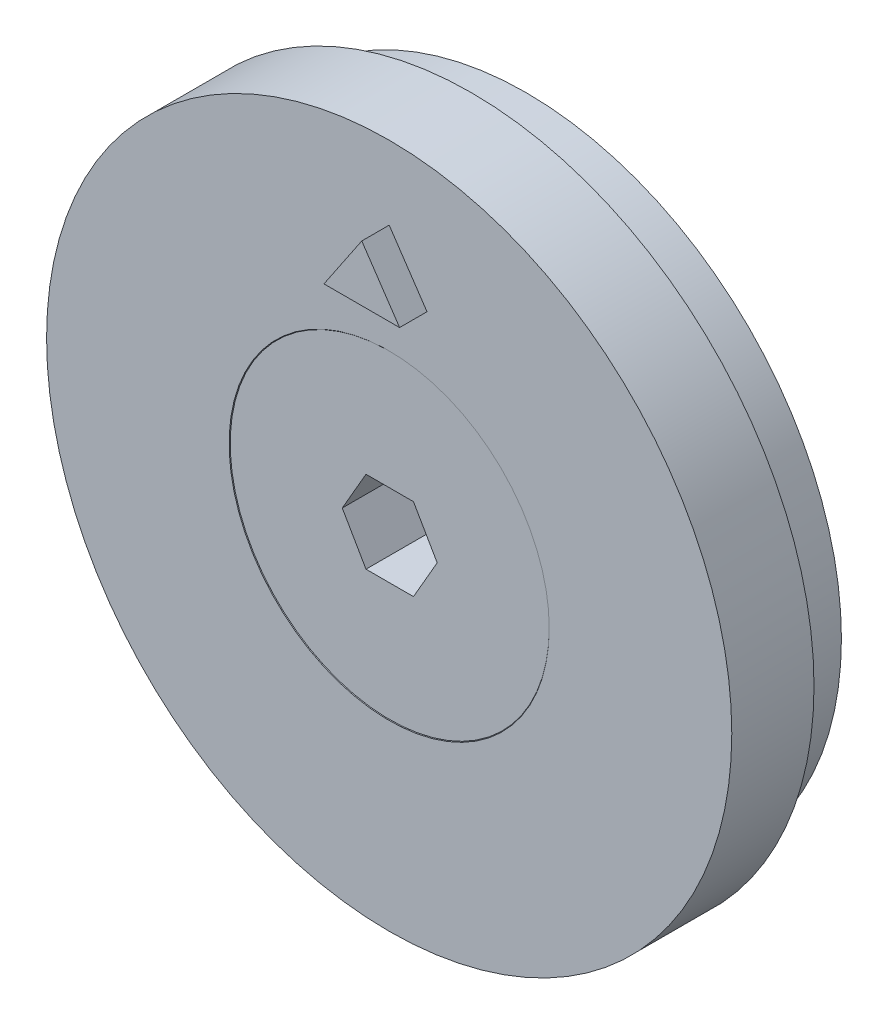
ISO-10303-21;
HEADER;
FILE_DESCRIPTION(('STEP AP214'),'2;1');
FILE_NAME('part.step','',(''),(''),'','','');
FILE_SCHEMA(('AUTOMOTIVE_DESIGN { 1 0 10303 214 1 1 1 1 }'));
ENDSEC;
DATA;
#1=APPLICATION_CONTEXT('core data for automotive mechanical design processes');
#2=APPLICATION_PROTOCOL_DEFINITION('international standard','automotive_design',2000,#1);
#3=PRODUCT_CONTEXT('',#1,'mechanical');
#4=PRODUCT('Part','Part','',(#3));
#5=PRODUCT_RELATED_PRODUCT_CATEGORY('part','',(#4));
#6=PRODUCT_DEFINITION_FORMATION('','',#4);
#7=PRODUCT_DEFINITION_CONTEXT('part definition',#1,'design');
#8=PRODUCT_DEFINITION('design','',#6,#7);
#9=PRODUCT_DEFINITION_SHAPE('','',#8);
#10=(LENGTH_UNIT() NAMED_UNIT(*) SI_UNIT(.MILLI.,.METRE.));
#11=(NAMED_UNIT(*) PLANE_ANGLE_UNIT() SI_UNIT($,.RADIAN.));
#12=(NAMED_UNIT(*) SI_UNIT($,.STERADIAN.) SOLID_ANGLE_UNIT());
#13=UNCERTAINTY_MEASURE_WITH_UNIT(LENGTH_MEASURE(1.E-05),#10,'distance_accuracy_value','');
#14=(GEOMETRIC_REPRESENTATION_CONTEXT(3) GLOBAL_UNCERTAINTY_ASSIGNED_CONTEXT((#13)) GLOBAL_UNIT_ASSIGNED_CONTEXT((#10,
#11,#12)) REPRESENTATION_CONTEXT('',''));
#15=CARTESIAN_POINT('',(0.,0.,0.));
#16=DIRECTION('',(0.,0.,1.));
#17=DIRECTION('',(1.,0.,0.));
#18=AXIS2_PLACEMENT_3D('',#15,#16,#17);
#19=CARTESIAN_POINT('',(0.,0.,-0.0199999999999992));
#20=DIRECTION('',(0.,0.,1.));
#21=DIRECTION('',(1.,0.,0.));
#22=AXIS2_PLACEMENT_3D('',#19,#20,#21);
#23=CYLINDRICAL_SURFACE('',#22,2.5);
#24=CARTESIAN_POINT('',(0.,0.,-3.34));
#25=DIRECTION('',(0.,0.,1.));
#26=DIRECTION('',(1.,0.,0.));
#27=AXIS2_PLACEMENT_3D('',#24,#25,#26);
#28=CIRCLE('',#27,2.5);
#29=CARTESIAN_POINT('',(2.5,0.,-3.34));
#30=VERTEX_POINT('',#29);
#31=EDGE_CURVE('P0_E11',#30,#30,#28,.T.);
#32=ORIENTED_EDGE('',*,*,#31,.F.);
#33=EDGE_LOOP('',(#32));
#34=FACE_BOUND('',#33,.T.);
#35=CARTESIAN_POINT('',(0.,0.,-9.77));
#36=DIRECTION('',(0.,0.,1.));
#37=DIRECTION('',(1.,0.,0.));
#38=AXIS2_PLACEMENT_3D('',#35,#36,#37);
#39=CIRCLE('',#38,2.5);
#40=CARTESIAN_POINT('',(2.5,0.,-9.77));
#41=VERTEX_POINT('',#40);
#42=EDGE_CURVE('P0_E136',#41,#41,#39,.T.);
#43=ORIENTED_EDGE('',*,*,#42,.T.);
#44=EDGE_LOOP('',(#43));
#45=FACE_BOUND('',#44,.T.);
#46=ADVANCED_FACE('P0_F35',(#34,#45),#23,.T.);
#47=CARTESIAN_POINT('',(0.,0.,-3.34));
#48=DIRECTION('',(0.,0.,1.));
#49=DIRECTION('',(1.,0.,0.));
#50=AXIS2_PLACEMENT_3D('',#47,#48,#49);
#51=CONICAL_SURFACE('',#50,2.5,0.785398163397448);
#52=CARTESIAN_POINT('',(0.,0.,-0.0199999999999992));
#53=DIRECTION('',(0.,0.,1.));
#54=DIRECTION('',(1.,0.,0.));
#55=AXIS2_PLACEMENT_3D('',#52,#53,#54);
#56=CIRCLE('',#55,5.82);
#57=CARTESIAN_POINT('',(5.82,0.,-0.0199999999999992));
#58=VERTEX_POINT('',#57);
#59=EDGE_CURVE('P0_E42',#58,#58,#56,.T.);
#60=ORIENTED_EDGE('',*,*,#59,.F.);
#61=EDGE_LOOP('',(#60));
#62=FACE_BOUND('',#61,.T.);
#63=ORIENTED_EDGE('',*,*,#31,.T.);
#64=EDGE_LOOP('',(#63));
#65=FACE_BOUND('',#64,.T.);
#66=ADVANCED_FACE('P0_F151',(#62,#65),#51,.T.);
#67=CARTESIAN_POINT('',(0.,5.82,-0.0199999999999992));
#68=DIRECTION('',(0.,0.,-1.));
#69=DIRECTION('',(-1.,0.,0.));
#70=AXIS2_PLACEMENT_3D('',#67,#68,#69);
#71=PLANE('',#70);
#72=DIRECTION('',(1.,0.,0.));
#73=VECTOR('',#72,1.);
#74=CARTESIAN_POINT('',(-0.866025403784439,-1.5,-0.0199999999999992));
#75=LINE('',#74,#73);
#76=CARTESIAN_POINT('',(-0.866025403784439,-1.5,-0.0199999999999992));
#77=VERTEX_POINT('',#76);
#78=CARTESIAN_POINT('',(0.866025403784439,-1.5,-0.0199999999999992));
#79=VERTEX_POINT('',#78);
#80=EDGE_CURVE('P0_E123',#77,#79,#75,.T.);
#81=ORIENTED_EDGE('',*,*,#80,.F.);
#82=DIRECTION('',(0.5,-0.866025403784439,0.));
#83=VECTOR('',#82,1.);
#84=CARTESIAN_POINT('',(-1.73205080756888,0.,-0.0199999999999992));
#85=LINE('',#84,#83);
#86=CARTESIAN_POINT('',(-1.73205080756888,0.,-0.0199999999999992));
#87=VERTEX_POINT('',#86);
#88=EDGE_CURVE('P0_E49',#87,#77,#85,.T.);
#89=ORIENTED_EDGE('',*,*,#88,.F.);
#90=DIRECTION('',(-0.5,-0.866025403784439,0.));
#91=VECTOR('',#90,1.);
#92=CARTESIAN_POINT('',(-0.866025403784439,1.5,-0.0199999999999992));
#93=LINE('',#92,#91);
#94=CARTESIAN_POINT('',(-0.866025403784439,1.5,-0.0199999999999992));
#95=VERTEX_POINT('',#94);
#96=EDGE_CURVE('P0_E132',#95,#87,#93,.T.);
#97=ORIENTED_EDGE('',*,*,#96,.F.);
#98=DIRECTION('',(-1.,0.,0.));
#99=VECTOR('',#98,1.);
#100=CARTESIAN_POINT('',(0.866025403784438,1.5,-0.0199999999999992));
#101=LINE('',#100,#99);
#102=CARTESIAN_POINT('',(0.866025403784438,1.5,-0.0199999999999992));
#103=VERTEX_POINT('',#102);
#104=EDGE_CURVE('P0_E130',#103,#95,#101,.T.);
#105=ORIENTED_EDGE('',*,*,#104,.F.);
#106=DIRECTION('',(-0.5,0.866025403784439,0.));
#107=VECTOR('',#106,1.);
#108=CARTESIAN_POINT('',(1.73205080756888,0.,-0.0199999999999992));
#109=LINE('',#108,#107);
#110=CARTESIAN_POINT('',(1.73205080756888,0.,-0.0199999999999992));
#111=VERTEX_POINT('',#110);
#112=EDGE_CURVE('P0_E97',#111,#103,#109,.T.);
#113=ORIENTED_EDGE('',*,*,#112,.F.);
#114=DIRECTION('',(0.5,0.866025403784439,0.));
#115=VECTOR('',#114,1.);
#116=CARTESIAN_POINT('',(0.866025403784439,-1.5,-0.0199999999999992));
#117=LINE('',#116,#115);
#118=EDGE_CURVE('P0_E126',#79,#111,#117,.T.);
#119=ORIENTED_EDGE('',*,*,#118,.F.);
#120=EDGE_LOOP('',(#81,#89,#97,#105,#113,#119));
#121=FACE_BOUND('',#120,.T.);
#122=ORIENTED_EDGE('',*,*,#59,.T.);
#123=EDGE_LOOP('',(#122));
#124=FACE_BOUND('',#123,.T.);
#125=ADVANCED_FACE('P0_F149',(#121,#124),#71,.F.);
#126=CARTESIAN_POINT('',(0.,0.,-10.02));
#127=DIRECTION('',(0.,0.,1.));
#128=DIRECTION('',(1.,0.,0.));
#129=AXIS2_PLACEMENT_3D('',#126,#127,#128);
#130=PLANE('',#129);
#131=CARTESIAN_POINT('',(0.,0.,-10.02));
#132=DIRECTION('',(0.,0.,1.));
#133=DIRECTION('',(1.,0.,0.));
#134=AXIS2_PLACEMENT_3D('',#131,#132,#133);
#135=CIRCLE('',#134,2.25);
#136=CARTESIAN_POINT('',(2.25,0.,-10.02));
#137=VERTEX_POINT('',#136);
#138=EDGE_CURVE('P0_E144',#137,#137,#135,.T.);
#139=ORIENTED_EDGE('',*,*,#138,.F.);
#140=EDGE_LOOP('',(#139));
#141=FACE_BOUND('',#140,.T.);
#142=ADVANCED_FACE('P0_F164',(#141),#130,.F.);
#143=CARTESIAN_POINT('',(0.,0.,-10.02));
#144=DIRECTION('',(0.,0.,1.));
#145=DIRECTION('',(1.,0.,0.));
#146=AXIS2_PLACEMENT_3D('',#143,#144,#145);
#147=CONICAL_SURFACE('',#146,2.25,0.78539816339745);
#148=ORIENTED_EDGE('',*,*,#42,.F.);
#149=EDGE_LOOP('',(#148));
#150=FACE_BOUND('',#149,.T.);
#151=ORIENTED_EDGE('',*,*,#138,.T.);
#152=EDGE_LOOP('',(#151));
#153=FACE_BOUND('',#152,.T.);
#154=ADVANCED_FACE('P0_F160',(#150,#153),#147,.T.);
#155=CARTESIAN_POINT('',(-1.73205080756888,0.,-2.52));
#156=DIRECTION('',(-0.866025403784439,-0.5,0.));
#157=DIRECTION('',(0.5,-0.866025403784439,0.));
#158=AXIS2_PLACEMENT_3D('',#155,#156,#157);
#159=PLANE('',#158);
#160=ORIENTED_EDGE('',*,*,#88,.T.);
#161=DIRECTION('',(0.,0.,1.));
#162=VECTOR('',#161,1.);
#163=CARTESIAN_POINT('',(-0.866025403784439,-1.5,-2.52));
#164=LINE('',#163,#162);
#165=CARTESIAN_POINT('',(-0.866025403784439,-1.5,-2.52));
#166=VERTEX_POINT('',#165);
#167=EDGE_CURVE('P0_E79',#166,#77,#164,.T.);
#168=ORIENTED_EDGE('',*,*,#167,.F.);
#169=DIRECTION('',(0.5,-0.866025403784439,0.));
#170=VECTOR('',#169,1.);
#171=CARTESIAN_POINT('',(-1.73205080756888,0.,-2.52));
#172=LINE('',#171,#170);
#173=CARTESIAN_POINT('',(-1.73205080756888,0.,-2.52));
#174=VERTEX_POINT('',#173);
#175=EDGE_CURVE('P0_E134',#174,#166,#172,.T.);
#176=ORIENTED_EDGE('',*,*,#175,.F.);
#177=DIRECTION('',(0.,0.,1.));
#178=VECTOR('',#177,1.);
#179=CARTESIAN_POINT('',(-1.73205080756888,0.,-2.52));
#180=LINE('',#179,#178);
#181=EDGE_CURVE('P0_E57',#174,#87,#180,.T.);
#182=ORIENTED_EDGE('',*,*,#181,.T.);
#183=EDGE_LOOP('',(#160,#168,#176,#182));
#184=FACE_BOUND('',#183,.T.);
#185=ADVANCED_FACE('P0_F163',(#184),#159,.F.);
#186=CARTESIAN_POINT('',(-0.866025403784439,1.5,-2.52));
#187=DIRECTION('',(-0.866025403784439,0.5,0.));
#188=DIRECTION('',(-0.5,-0.866025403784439,0.));
#189=AXIS2_PLACEMENT_3D('',#186,#187,#188);
#190=PLANE('',#189);
#191=ORIENTED_EDGE('',*,*,#96,.T.);
#192=ORIENTED_EDGE('',*,*,#181,.F.);
#193=DIRECTION('',(-0.5,-0.866025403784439,0.));
#194=VECTOR('',#193,1.);
#195=CARTESIAN_POINT('',(-0.866025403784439,1.5,-2.52));
#196=LINE('',#195,#194);
#197=CARTESIAN_POINT('',(-0.866025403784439,1.5,-2.52));
#198=VERTEX_POINT('',#197);
#199=EDGE_CURVE('P0_E109',#198,#174,#196,.T.);
#200=ORIENTED_EDGE('',*,*,#199,.F.);
#201=DIRECTION('',(0.,0.,1.));
#202=VECTOR('',#201,1.);
#203=CARTESIAN_POINT('',(-0.866025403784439,1.5,-2.52));
#204=LINE('',#203,#202);
#205=EDGE_CURVE('P0_E101',#198,#95,#204,.T.);
#206=ORIENTED_EDGE('',*,*,#205,.T.);
#207=EDGE_LOOP('',(#191,#192,#200,#206));
#208=FACE_BOUND('',#207,.T.);
#209=ADVANCED_FACE('P0_F178',(#208),#190,.F.);
#210=CARTESIAN_POINT('',(0.866025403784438,1.5,-2.52));
#211=DIRECTION('',(0.,1.,0.));
#212=DIRECTION('',(-1.,0.,0.));
#213=AXIS2_PLACEMENT_3D('',#210,#211,#212);
#214=PLANE('',#213);
#215=ORIENTED_EDGE('',*,*,#104,.T.);
#216=ORIENTED_EDGE('',*,*,#205,.F.);
#217=DIRECTION('',(-1.,0.,0.));
#218=VECTOR('',#217,1.);
#219=CARTESIAN_POINT('',(0.866025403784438,1.5,-2.52));
#220=LINE('',#219,#218);
#221=CARTESIAN_POINT('',(0.866025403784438,1.5,-2.52));
#222=VERTEX_POINT('',#221);
#223=EDGE_CURVE('P0_E105',#222,#198,#220,.T.);
#224=ORIENTED_EDGE('',*,*,#223,.F.);
#225=DIRECTION('',(0.,0.,1.));
#226=VECTOR('',#225,1.);
#227=CARTESIAN_POINT('',(0.866025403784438,1.5,-2.52));
#228=LINE('',#227,#226);
#229=EDGE_CURVE('P0_E90',#222,#103,#228,.T.);
#230=ORIENTED_EDGE('',*,*,#229,.T.);
#231=EDGE_LOOP('',(#215,#216,#224,#230));
#232=FACE_BOUND('',#231,.T.);
#233=ADVANCED_FACE('P0_F106',(#232),#214,.F.);
#234=CARTESIAN_POINT('',(1.73205080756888,0.,-2.52));
#235=DIRECTION('',(0.866025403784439,0.5,0.));
#236=DIRECTION('',(-0.5,0.866025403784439,0.));
#237=AXIS2_PLACEMENT_3D('',#234,#235,#236);
#238=PLANE('',#237);
#239=ORIENTED_EDGE('',*,*,#112,.T.);
#240=ORIENTED_EDGE('',*,*,#229,.F.);
#241=DIRECTION('',(-0.5,0.866025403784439,0.));
#242=VECTOR('',#241,1.);
#243=CARTESIAN_POINT('',(1.73205080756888,0.,-2.52));
#244=LINE('',#243,#242);
#245=CARTESIAN_POINT('',(1.73205080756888,0.,-2.52));
#246=VERTEX_POINT('',#245);
#247=EDGE_CURVE('P0_E94',#246,#222,#244,.T.);
#248=ORIENTED_EDGE('',*,*,#247,.F.);
#249=DIRECTION('',(0.,0.,1.));
#250=VECTOR('',#249,1.);
#251=CARTESIAN_POINT('',(1.73205080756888,0.,-2.52));
#252=LINE('',#251,#250);
#253=EDGE_CURVE('P0_E102',#246,#111,#252,.T.);
#254=ORIENTED_EDGE('',*,*,#253,.T.);
#255=EDGE_LOOP('',(#239,#240,#248,#254));
#256=FACE_BOUND('',#255,.T.);
#257=ADVANCED_FACE('P0_F92',(#256),#238,.F.);
#258=CARTESIAN_POINT('',(0.866025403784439,-1.5,-2.52));
#259=DIRECTION('',(0.866025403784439,-0.5,0.));
#260=DIRECTION('',(0.5,0.866025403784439,0.));
#261=AXIS2_PLACEMENT_3D('',#258,#259,#260);
#262=PLANE('',#261);
#263=ORIENTED_EDGE('',*,*,#118,.T.);
#264=ORIENTED_EDGE('',*,*,#253,.F.);
#265=DIRECTION('',(0.5,0.866025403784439,0.));
#266=VECTOR('',#265,1.);
#267=CARTESIAN_POINT('',(0.866025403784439,-1.5,-2.52));
#268=LINE('',#267,#266);
#269=CARTESIAN_POINT('',(0.866025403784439,-1.5,-2.52));
#270=VERTEX_POINT('',#269);
#271=EDGE_CURVE('P0_E115',#270,#246,#268,.T.);
#272=ORIENTED_EDGE('',*,*,#271,.F.);
#273=DIRECTION('',(0.,0.,1.));
#274=VECTOR('',#273,1.);
#275=CARTESIAN_POINT('',(0.866025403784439,-1.5,-2.52));
#276=LINE('',#275,#274);
#277=EDGE_CURVE('P0_E139',#270,#79,#276,.T.);
#278=ORIENTED_EDGE('',*,*,#277,.T.);
#279=EDGE_LOOP('',(#263,#264,#272,#278));
#280=FACE_BOUND('',#279,.T.);
#281=ADVANCED_FACE('P0_F182',(#280),#262,.F.);
#282=CARTESIAN_POINT('',(-0.866025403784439,-1.5,-2.52));
#283=DIRECTION('',(0.,-1.,0.));
#284=DIRECTION('',(0.,0.,-1.));
#285=AXIS2_PLACEMENT_3D('',#282,#283,#284);
#286=PLANE('',#285);
#287=ORIENTED_EDGE('',*,*,#80,.T.);
#288=ORIENTED_EDGE('',*,*,#277,.F.);
#289=DIRECTION('',(1.,0.,0.));
#290=VECTOR('',#289,1.);
#291=CARTESIAN_POINT('',(-0.866025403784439,-1.5,-2.52));
#292=LINE('',#291,#290);
#293=EDGE_CURVE('P0_E117',#166,#270,#292,.T.);
#294=ORIENTED_EDGE('',*,*,#293,.F.);
#295=ORIENTED_EDGE('',*,*,#167,.T.);
#296=EDGE_LOOP('',(#287,#288,#294,#295));
#297=FACE_BOUND('',#296,.T.);
#298=ADVANCED_FACE('P0_F179',(#297),#286,.F.);
#299=CARTESIAN_POINT('',(0.,0.,-2.52));
#300=DIRECTION('',(0.,0.,1.));
#301=DIRECTION('',(1.,0.,0.));
#302=AXIS2_PLACEMENT_3D('',#299,#300,#301);
#303=PLANE('',#302);
#304=ORIENTED_EDGE('',*,*,#175,.T.);
#305=ORIENTED_EDGE('',*,*,#293,.T.);
#306=ORIENTED_EDGE('',*,*,#271,.T.);
#307=ORIENTED_EDGE('',*,*,#247,.T.);
#308=ORIENTED_EDGE('',*,*,#223,.T.);
#309=ORIENTED_EDGE('',*,*,#199,.T.);
#310=EDGE_LOOP('',(#304,#305,#306,#307,#308,#309));
#311=FACE_BOUND('',#310,.T.);
#312=ADVANCED_FACE('P0_F112',(#311),#303,.T.);
#313=CLOSED_SHELL('',(#46,#66,#125,#142,#154,#185,#209,#233,#257,#281,#298,#312));
#314=MANIFOLD_SOLID_BREP('P0_B2',#313);
#315=CARTESIAN_POINT('',(0.,12.5,0.));
#316=DIRECTION('',(0.,0.,-1.));
#317=DIRECTION('',(-1.,0.,0.));
#318=AXIS2_PLACEMENT_3D('',#315,#316,#317);
#319=PLANE('',#318);
#320=CARTESIAN_POINT('',(0.,0.,0.));
#321=DIRECTION('',(0.,0.,1.));
#322=DIRECTION('',(1.,0.,0.));
#323=AXIS2_PLACEMENT_3D('',#320,#321,#322);
#324=CIRCLE('',#323,12.5);
#325=CARTESIAN_POINT('',(12.5,0.,0.));
#326=VERTEX_POINT('',#325);
#327=EDGE_CURVE('P1_E11',#326,#326,#324,.T.);
#328=ORIENTED_EDGE('',*,*,#327,.T.);
#329=EDGE_LOOP('',(#328));
#330=FACE_BOUND('',#329,.T.);
#331=CARTESIAN_POINT('',(0.,0.,0.));
#332=DIRECTION('',(0.,0.,1.));
#333=DIRECTION('',(1.,0.,0.));
#334=AXIS2_PLACEMENT_3D('',#331,#332,#333);
#335=CIRCLE('',#334,5.84);
#336=CARTESIAN_POINT('',(5.84,0.,0.));
#337=VERTEX_POINT('',#336);
#338=EDGE_CURVE('P1_E25',#337,#337,#335,.T.);
#339=ORIENTED_EDGE('',*,*,#338,.F.);
#340=EDGE_LOOP('',(#339));
#341=FACE_BOUND('',#340,.T.);
#342=DIRECTION('',(1.,0.,0.));
#343=VECTOR('',#342,1.);
#344=CARTESIAN_POINT('',(-1.3800444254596,7.76799984,0.));
#345=LINE('',#344,#343);
#346=CARTESIAN_POINT('',(-1.3800444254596,7.76799984,0.));
#347=VERTEX_POINT('',#346);
#348=CARTESIAN_POINT('',(1.3800444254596,7.76799984,0.));
#349=VERTEX_POINT('',#348);
#350=EDGE_CURVE('P1_E69',#347,#349,#345,.T.);
#351=ORIENTED_EDGE('',*,*,#350,.F.);
#352=DIRECTION('',(-0.559192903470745,-0.829037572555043,0.));
#353=VECTOR('',#352,1.);
#354=CARTESIAN_POINT('',(0.,9.81399984,0.));
#355=LINE('',#354,#353);
#356=CARTESIAN_POINT('',(0.,9.81399984,0.));
#357=VERTEX_POINT('',#356);
#358=EDGE_CURVE('P1_E36',#357,#347,#355,.T.);
#359=ORIENTED_EDGE('',*,*,#358,.F.);
#360=DIRECTION('',(-0.559192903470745,0.829037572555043,0.));
#361=VECTOR('',#360,1.);
#362=CARTESIAN_POINT('',(1.3800444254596,7.76799984,0.));
#363=LINE('',#362,#361);
#364=EDGE_CURVE('P1_E32',#349,#357,#363,.T.);
#365=ORIENTED_EDGE('',*,*,#364,.F.);
#366=EDGE_LOOP('',(#351,#359,#365));
#367=FACE_BOUND('',#366,.T.);
#368=ADVANCED_FACE('P1_F17',(#330,#341,#367),#319,.F.);
#369=CARTESIAN_POINT('',(0.,0.,3.12219627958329));
#370=DIRECTION('',(0.,0.,1.));
#371=DIRECTION('',(1.,0.,0.));
#372=AXIS2_PLACEMENT_3D('',#369,#370,#371);
#373=CYLINDRICAL_SURFACE('',#372,12.5);
#374=ORIENTED_EDGE('',*,*,#327,.F.);
#375=EDGE_LOOP('',(#374));
#376=FACE_BOUND('',#375,.T.);
#377=CARTESIAN_POINT('',(0.,0.,-3.));
#378=DIRECTION('',(0.,0.,1.));
#379=DIRECTION('',(1.,0.,0.));
#380=AXIS2_PLACEMENT_3D('',#377,#378,#379);
#381=CIRCLE('',#380,12.5);
#382=CARTESIAN_POINT('',(12.5,0.,-3.));
#383=VERTEX_POINT('',#382);
#384=EDGE_CURVE('P1_E70',#383,#383,#381,.T.);
#385=ORIENTED_EDGE('',*,*,#384,.T.);
#386=EDGE_LOOP('',(#385));
#387=FACE_BOUND('',#386,.T.);
#388=ADVANCED_FACE('P1_F19',(#376,#387),#373,.T.);
#389=CARTESIAN_POINT('',(0.,0.,0.));
#390=DIRECTION('',(0.,0.,1.));
#391=DIRECTION('',(1.,0.,0.));
#392=AXIS2_PLACEMENT_3D('',#389,#390,#391);
#393=CONICAL_SURFACE('',#392,5.84,0.785398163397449);
#394=CARTESIAN_POINT('',(0.,0.,-3.34));
#395=DIRECTION('',(0.,0.,1.));
#396=DIRECTION('',(1.,0.,0.));
#397=AXIS2_PLACEMENT_3D('',#394,#395,#396);
#398=CIRCLE('',#397,2.5);
#399=CARTESIAN_POINT('',(2.5,0.,-3.34));
#400=VERTEX_POINT('',#399);
#401=EDGE_CURVE('P1_E87',#400,#400,#398,.T.);
#402=ORIENTED_EDGE('',*,*,#401,.F.);
#403=EDGE_LOOP('',(#402));
#404=FACE_BOUND('',#403,.T.);
#405=ORIENTED_EDGE('',*,*,#338,.T.);
#406=EDGE_LOOP('',(#405));
#407=FACE_BOUND('',#406,.T.);
#408=ADVANCED_FACE('P1_F92',(#404,#407),#393,.F.);
#409=CARTESIAN_POINT('',(0.,0.,3.12219627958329));
#410=DIRECTION('',(0.,0.,1.));
#411=DIRECTION('',(1.,0.,0.));
#412=AXIS2_PLACEMENT_3D('',#409,#410,#411);
#413=CYLINDRICAL_SURFACE('',#412,2.5);
#414=CARTESIAN_POINT('',(0.,0.,-5.));
#415=DIRECTION('',(0.,0.,1.));
#416=DIRECTION('',(1.,0.,0.));
#417=AXIS2_PLACEMENT_3D('',#414,#415,#416);
#418=CIRCLE('',#417,2.5);
#419=CARTESIAN_POINT('',(2.5,0.,-5.));
#420=VERTEX_POINT('',#419);
#421=EDGE_CURVE('P1_E84',#420,#420,#418,.T.);
#422=ORIENTED_EDGE('',*,*,#421,.F.);
#423=EDGE_LOOP('',(#422));
#424=FACE_BOUND('',#423,.T.);
#425=ORIENTED_EDGE('',*,*,#401,.T.);
#426=EDGE_LOOP('',(#425));
#427=FACE_BOUND('',#426,.T.);
#428=ADVANCED_FACE('P1_F126',(#424,#427),#413,.F.);
#429=CARTESIAN_POINT('',(0.,2.5,-5.));
#430=DIRECTION('',(0.,0.,1.));
#431=DIRECTION('',(1.,0.,0.));
#432=AXIS2_PLACEMENT_3D('',#429,#430,#431);
#433=PLANE('',#432);
#434=CARTESIAN_POINT('',(0.,0.,-5.));
#435=DIRECTION('',(0.,0.,1.));
#436=DIRECTION('',(1.,0.,0.));
#437=AXIS2_PLACEMENT_3D('',#434,#435,#436);
#438=CIRCLE('',#437,11.5);
#439=CARTESIAN_POINT('',(11.5,0.,-5.));
#440=VERTEX_POINT('',#439);
#441=EDGE_CURVE('P1_E81',#440,#440,#438,.T.);
#442=ORIENTED_EDGE('',*,*,#441,.F.);
#443=EDGE_LOOP('',(#442));
#444=FACE_BOUND('',#443,.T.);
#445=ORIENTED_EDGE('',*,*,#421,.T.);
#446=EDGE_LOOP('',(#445));
#447=FACE_BOUND('',#446,.T.);
#448=ADVANCED_FACE('P1_F122',(#444,#447),#433,.F.);
#449=CARTESIAN_POINT('',(0.,0.,3.12219627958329));
#450=DIRECTION('',(0.,0.,1.));
#451=DIRECTION('',(1.,0.,0.));
#452=AXIS2_PLACEMENT_3D('',#449,#450,#451);
#453=CYLINDRICAL_SURFACE('',#452,11.5);
#454=CARTESIAN_POINT('',(0.,0.,-3.));
#455=DIRECTION('',(0.,0.,1.));
#456=DIRECTION('',(1.,0.,0.));
#457=AXIS2_PLACEMENT_3D('',#454,#455,#456);
#458=CIRCLE('',#457,11.5);
#459=CARTESIAN_POINT('',(11.5,0.,-3.));
#460=VERTEX_POINT('',#459);
#461=EDGE_CURVE('P1_E73',#460,#460,#458,.T.);
#462=ORIENTED_EDGE('',*,*,#461,.F.);
#463=EDGE_LOOP('',(#462));
#464=FACE_BOUND('',#463,.T.);
#465=ORIENTED_EDGE('',*,*,#441,.T.);
#466=EDGE_LOOP('',(#465));
#467=FACE_BOUND('',#466,.T.);
#468=ADVANCED_FACE('P1_F118',(#464,#467),#453,.T.);
#469=CARTESIAN_POINT('',(0.,11.5,-3.));
#470=DIRECTION('',(0.,0.,1.));
#471=DIRECTION('',(1.,0.,0.));
#472=AXIS2_PLACEMENT_3D('',#469,#470,#471);
#473=PLANE('',#472);
#474=ORIENTED_EDGE('',*,*,#384,.F.);
#475=EDGE_LOOP('',(#474));
#476=FACE_BOUND('',#475,.T.);
#477=ORIENTED_EDGE('',*,*,#461,.T.);
#478=EDGE_LOOP('',(#477));
#479=FACE_BOUND('',#478,.T.);
#480=ADVANCED_FACE('P1_F115',(#476,#479),#473,.F.);
#481=CARTESIAN_POINT('',(-1.3800444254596,7.76799984,1.));
#482=DIRECTION('',(0.,1.,0.));
#483=DIRECTION('',(0.,0.,1.));
#484=AXIS2_PLACEMENT_3D('',#481,#482,#483);
#485=PLANE('',#484);
#486=ORIENTED_EDGE('',*,*,#350,.T.);
#487=DIRECTION('',(0.,0.,-1.));
#488=VECTOR('',#487,1.);
#489=CARTESIAN_POINT('',(1.3800444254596,7.76799984,1.));
#490=LINE('',#489,#488);
#491=CARTESIAN_POINT('',(1.3800444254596,7.76799984,1.));
#492=VERTEX_POINT('',#491);
#493=EDGE_CURVE('P1_E53',#492,#349,#490,.T.);
#494=ORIENTED_EDGE('',*,*,#493,.F.);
#495=DIRECTION('',(1.,0.,0.));
#496=VECTOR('',#495,1.);
#497=CARTESIAN_POINT('',(-1.3800444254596,7.76799984,1.));
#498=LINE('',#497,#496);
#499=CARTESIAN_POINT('',(-1.3800444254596,7.76799984,1.));
#500=VERTEX_POINT('',#499);
#501=EDGE_CURVE('P1_E60',#500,#492,#498,.T.);
#502=ORIENTED_EDGE('',*,*,#501,.F.);
#503=DIRECTION('',(0.,0.,-1.));
#504=VECTOR('',#503,1.);
#505=CARTESIAN_POINT('',(-1.3800444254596,7.76799984,1.));
#506=LINE('',#505,#504);
#507=EDGE_CURVE('P1_E75',#500,#347,#506,.T.);
#508=ORIENTED_EDGE('',*,*,#507,.T.);
#509=EDGE_LOOP('',(#486,#494,#502,#508));
#510=FACE_BOUND('',#509,.T.);
#511=ADVANCED_FACE('P1_F68',(#510),#485,.F.);
#512=CARTESIAN_POINT('',(1.3800444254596,7.76799984,1.));
#513=DIRECTION('',(-0.829037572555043,-0.559192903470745,0.));
#514=DIRECTION('',(0.559192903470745,-0.829037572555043,0.));
#515=AXIS2_PLACEMENT_3D('',#512,#513,#514);
#516=PLANE('',#515);
#517=ORIENTED_EDGE('',*,*,#364,.T.);
#518=DIRECTION('',(0.,0.,-1.));
#519=VECTOR('',#518,1.);
#520=CARTESIAN_POINT('',(0.,9.81399984,1.));
#521=LINE('',#520,#519);
#522=CARTESIAN_POINT('',(0.,9.81399984,1.));
#523=VERTEX_POINT('',#522);
#524=EDGE_CURVE('P1_E56',#523,#357,#521,.T.);
#525=ORIENTED_EDGE('',*,*,#524,.F.);
#526=DIRECTION('',(-0.559192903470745,0.829037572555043,0.));
#527=VECTOR('',#526,1.);
#528=CARTESIAN_POINT('',(1.3800444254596,7.76799984,1.));
#529=LINE('',#528,#527);
#530=EDGE_CURVE('P1_E49',#492,#523,#529,.T.);
#531=ORIENTED_EDGE('',*,*,#530,.F.);
#532=ORIENTED_EDGE('',*,*,#493,.T.);
#533=EDGE_LOOP('',(#517,#525,#531,#532));
#534=FACE_BOUND('',#533,.T.);
#535=ADVANCED_FACE('P1_F51',(#534),#516,.F.);
#536=CARTESIAN_POINT('',(0.,9.81399984,1.));
#537=DIRECTION('',(0.829037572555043,-0.559192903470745,0.));
#538=DIRECTION('',(0.559192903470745,0.829037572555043,0.));
#539=AXIS2_PLACEMENT_3D('',#536,#537,#538);
#540=PLANE('',#539);
#541=ORIENTED_EDGE('',*,*,#358,.T.);
#542=ORIENTED_EDGE('',*,*,#507,.F.);
#543=DIRECTION('',(-0.559192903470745,-0.829037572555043,0.));
#544=VECTOR('',#543,1.);
#545=CARTESIAN_POINT('',(0.,9.81399984,1.));
#546=LINE('',#545,#544);
#547=EDGE_CURVE('P1_E59',#523,#500,#546,.T.);
#548=ORIENTED_EDGE('',*,*,#547,.F.);
#549=ORIENTED_EDGE('',*,*,#524,.T.);
#550=EDGE_LOOP('',(#541,#542,#548,#549));
#551=FACE_BOUND('',#550,.T.);
#552=ADVANCED_FACE('P1_F98',(#551),#540,.F.);
#553=CARTESIAN_POINT('',(1.3800444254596,7.76799984,1.));
#554=DIRECTION('',(0.,0.,1.));
#555=DIRECTION('',(1.,0.,0.));
#556=AXIS2_PLACEMENT_3D('',#553,#554,#555);
#557=PLANE('',#556);
#558=ORIENTED_EDGE('',*,*,#501,.T.);
#559=ORIENTED_EDGE('',*,*,#530,.T.);
#560=ORIENTED_EDGE('',*,*,#547,.T.);
#561=EDGE_LOOP('',(#558,#559,#560));
#562=FACE_BOUND('',#561,.T.);
#563=ADVANCED_FACE('P1_F63',(#562),#557,.T.);
#564=CLOSED_SHELL('',(#368,#388,#408,#428,#448,#468,#480,#511,#535,#552,#563));
#565=MANIFOLD_SOLID_BREP('P1_B1',#564);
#566=ADVANCED_BREP_SHAPE_REPRESENTATION('',(#18,#314,#565),#14);
#567=SHAPE_DEFINITION_REPRESENTATION(#9,#566);
ENDSEC;
END-ISO-10303-21;
